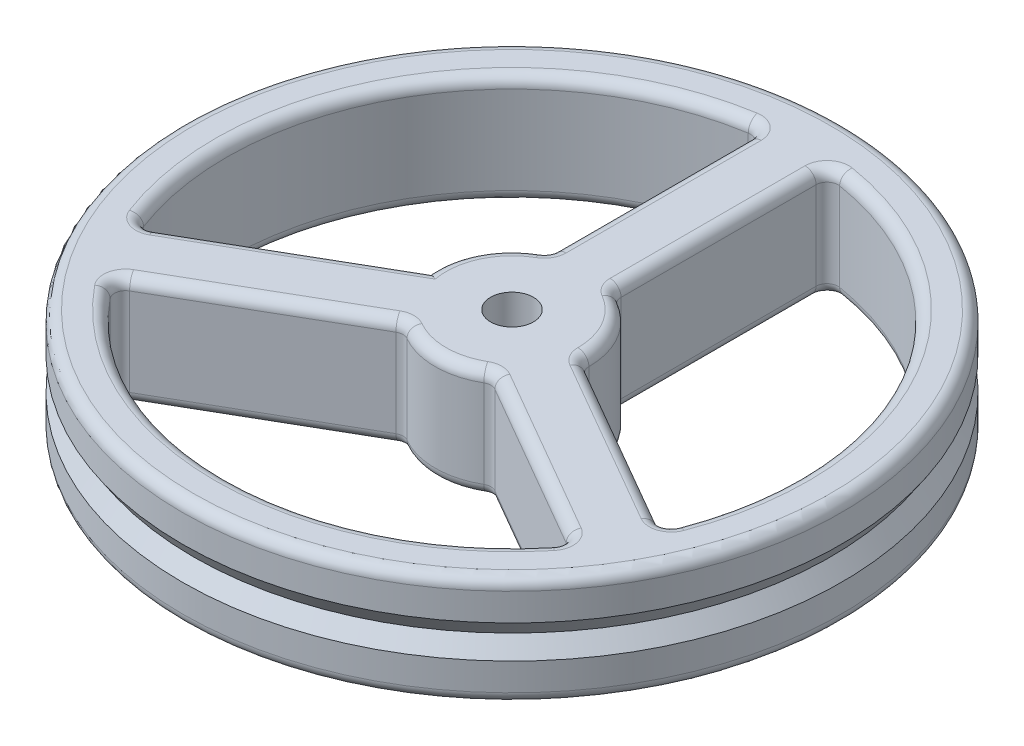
from build123d import *

# Parameters (mm, degrees)
SKETCH1_R           = 30
BOSS_EXTRUDE1_DEPTH = 10
FILLET1_R           = 1
SKETCH3_R           = 1.95
CUT_EXTRUDE1_DEPTH  = 44.588989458


with BuildPart() as part:
    # Sketch1 → Boss-Extrude1 (new body)
    with BuildSketch(Plane(origin=(0, 0, 0), x_dir=(1, 0, 0), z_dir=(0, 1, 0))):
        with Locations(Location((0, 0, 0), (0, 0, 270))):
            Circle(SKETCH1_R)
        with BuildLine():
            Line((3, 25.82634314), (3, 6.32455532))
            ThreePointArc((3, 6.32455532), (6.062177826, 3.5), (6.977225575, -0.564201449))
            Line((6.977225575, -0.564201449), (23.866269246, -10.315095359))
            ThreePointArc((23.866269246, -10.315095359), (22.516660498, 13), (3, 25.82634314))
        make_face(mode=Mode.SUBTRACT)
        with BuildLine():
            Line((-3, 25.82634314), (-3, 6.32455532))
            ThreePointArc((-3, 6.32455532), (-6.062177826, 3.5), (-6.977225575, -0.564201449))
            Line((-6.977225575, -0.564201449), (-23.866269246, -10.315095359))
            ThreePointArc((-23.866269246, -10.315095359), (-22.516660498, 13), (-3, 25.82634314))
        make_face(mode=Mode.SUBTRACT)
        with BuildLine():
            Line((20.866269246, -15.511247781), (3.977225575, -5.760353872))
            ThreePointArc((3.977225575, -5.760353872), (0, -7), (-3.977225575, -5.760353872))
            Line((-3.977225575, -5.760353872), (-20.866269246, -15.511247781))
            ThreePointArc((-20.866269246, -15.511247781), (0, -26), (20.866269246, -15.511247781))
        make_face(mode=Mode.SUBTRACT)
    extrude(amount=BOSS_EXTRUDE1_DEPTH)

    # Fillet1
    fillet1_edges = [part.edges().sort_by_distance(p)[0] for p in [
        (6.062177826, 10, -3.5),
        (15.421747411, 10, 5.439648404),
        (0, 0, -30),
        (-22.516660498, 0, -13),
        (-3, 5, -25.82634314),
        (-15.421747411, 0, 5.439648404),
        (-23.866269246, 5, 10.315095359),
        (-6.062177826, 0, -3.5),
        (-3, 0, -16.07544923),
        (-3, 5, -6.32455532),
        (-22.516660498, 10, -13),
        (-15.421747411, 10, 5.439648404),
        (-6.062177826, 10, -3.5),
        (-3, 10, -16.07544923),
        (0, 0, 26),
        (-20.866269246, 5, 15.511247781),
        (12.421747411, 0, 10.635800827),
        (20.866269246, 5, 15.511247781),
        (0, 0, 7),
        (3.977225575, 5, 5.760353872),
        (-12.421747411, 0, 10.635800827),
        (-3.977225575, 5, 5.760353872),
        (0, 10, 26),
        (12.421747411, 10, 10.635800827),
        (0, 10, 7),
        (-12.421747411, 10, 10.635800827),
        (0, 10, -30),
        (22.516660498, 0, -13),
        (23.866269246, 5, 10.315095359),
        (3, 0, -16.07544923),
        (3, 5, -25.82634314),
        (6.062177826, 0, -3.5),
        (3, 5, -6.32455532),
        (15.421747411, 0, 5.439648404),
        (6.977225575, 5, 0.564201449),
        (22.516660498, 10, -13),
        (3, 10, -16.07544923),
    ]]
    fillet(fillet1_edges, radius=FILLET1_R)

    # Sketch3 → Cut-Extrude1 (cut, through all)
    with BuildSketch(Plane.XZ):
        with Locations(Location((0, 0, 0), (0, 0, 270))):
            Circle(SKETCH3_R)
    extrude(amount=-CUT_EXTRUDE1_DEPTH, mode=Mode.SUBTRACT)

    # Sketch4 → Cut-Revolve1 (revolve, cut)
    with BuildSketch(Plane(origin=(0, 0, 0), x_dir=(0, 0, -1), z_dir=(1, 0, 0))):
        Polygon((-30, 3.5), (-30, 6.5), (-29, 5), align=None)
    revolve(axis=Axis((0, 10, 0), (0, -1, 0)), mode=Mode.SUBTRACT)


solid = part.part
